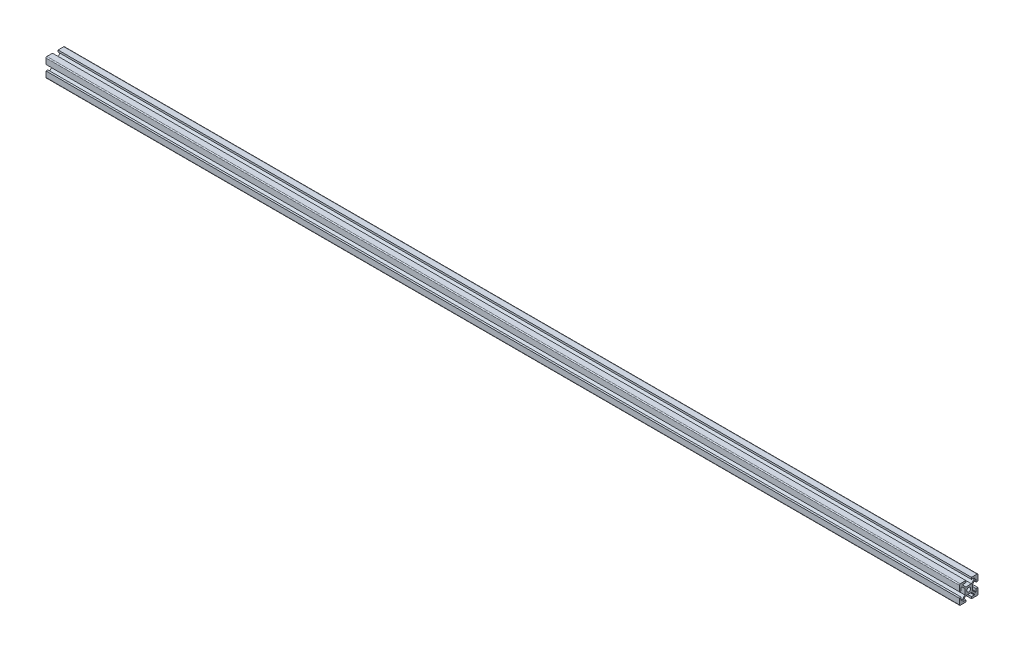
from build123d import *

# Parameters (mm, degrees)
SKETCH1_R           = 2.1
BOSS_EXTRUDE1_DEPTH = 980


with BuildPart() as part:
    # Sketch1 → Boss-Extrude1 (new body)
    with BuildSketch(Plane(origin=(0, 0, 0), x_dir=(0, 0, -1), z_dir=(1, 0, 0))):
        with BuildLine():
            Line((-10, 9), (-10, 3))
            Line((-10, 3), (-8, 3))
            Line((-8, 3), (-8, 6))
            Line((-8, 6), (-7.060660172, 6))
            Line((-7.060660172, 6), (-4, 2.939339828))
            Line((-4, 2.939339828), (-4, -2.939339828))
            Line((-4, -2.939339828), (-7.060660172, -6))
            Line((-7.060660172, -6), (-8, -6))
            Line((-8, -6), (-8, -3))
            Line((-8, -3), (-10, -3))
            Line((-10, -3), (-10, -9))
            ThreePointArc((-10, -9), (-9.707106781, -9.707106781), (-9, -10))
            Line((-9, -10), (-3, -10))
            Line((-3, -10), (-3, -8))
            Line((-3, -8), (-6, -8))
            Line((-6, -8), (-6, -7.060660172))
            Line((-6, -7.060660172), (-2.939339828, -4))
            Line((-2.939339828, -4), (2.939339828, -4))
            Line((2.939339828, -4), (6, -7.060660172))
            Line((6, -7.060660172), (6, -8))
            Line((6, -8), (3, -8))
            Line((3, -8), (3, -10))
            Line((3, -10), (9, -10))
            ThreePointArc((9, -10), (9.707106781, -9.707106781), (10, -9))
            Line((10, -9), (10, -3))
            Line((10, -3), (8, -3))
            Line((8, -3), (8, -6))
            Line((8, -6), (7.060660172, -6))
            Line((7.060660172, -6), (4, -2.939339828))
            Line((4, -2.939339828), (4, 2.939339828))
            Line((4, 2.939339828), (7.060660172, 6))
            Line((7.060660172, 6), (8, 6))
            Line((8, 6), (8, 3))
            Line((8, 3), (10, 3))
            Line((10, 3), (10, 9))
            ThreePointArc((10, 9), (9.707106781, 9.707106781), (9, 10))
            Line((9, 10), (3, 10))
            Line((3, 10), (3, 8))
            Line((3, 8), (6, 8))
            Line((6, 8), (6, 7.060660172))
            Line((6, 7.060660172), (2.939339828, 4))
            Line((2.939339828, 4), (-2.939339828, 4))
            Line((-2.939339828, 4), (-6, 7.060660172))
            Line((-6, 7.060660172), (-6, 8))
            Line((-6, 8), (-3, 8))
            Line((-3, 8), (-3, 10))
            Line((-3, 10), (-9, 10))
            ThreePointArc((-9, 10), (-9.707106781, 9.707106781), (-10, 9))
        make_face()
        Circle(SKETCH1_R, mode=Mode.SUBTRACT)
    extrude(amount=BOSS_EXTRUDE1_DEPTH)


solid = part.part
